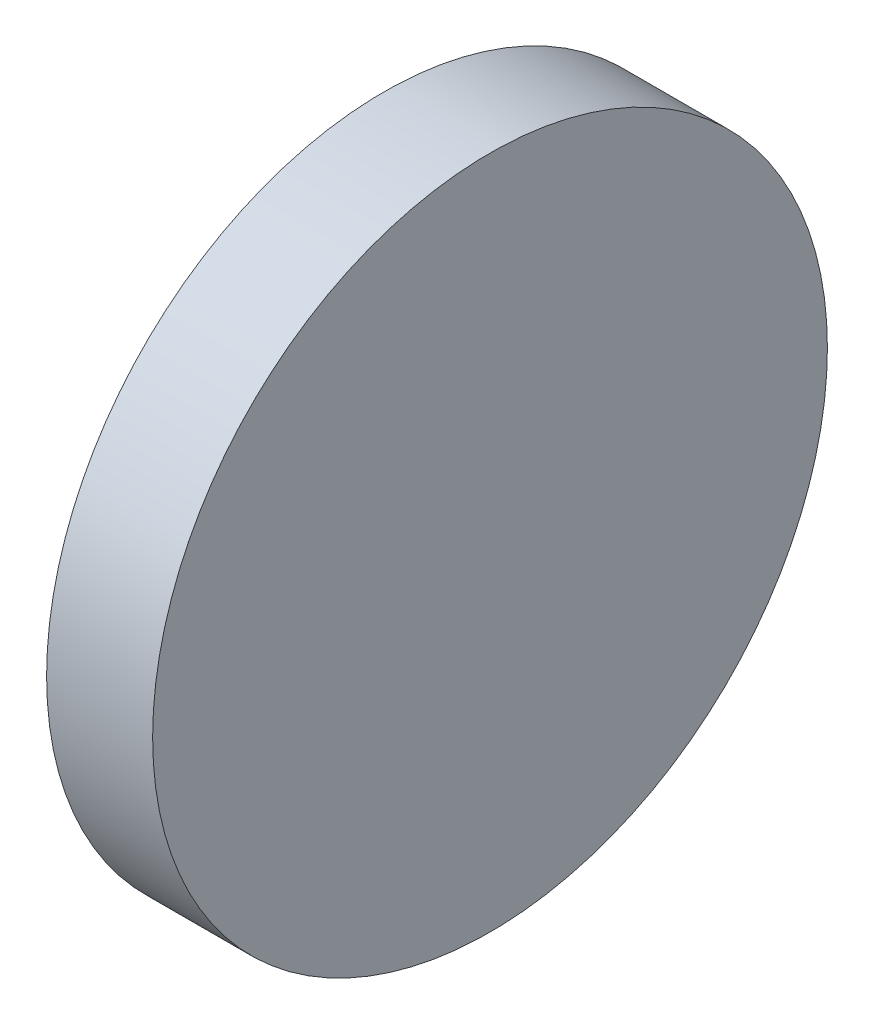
from build123d import *

# Parameters (mm, degrees)
SKETCH1_R              = 8.89
CIRCULAR_SECTION_DEPTH = 2.794


with BuildPart() as part:
    # Sketch1 → Circular_section (new body)
    with BuildSketch(Plane.YZ):
        with Locations(Location((0, 0, 0), (0, 0, 270))):
            Circle(SKETCH1_R)
    extrude(amount=CIRCULAR_SECTION_DEPTH)


solid = part.part
